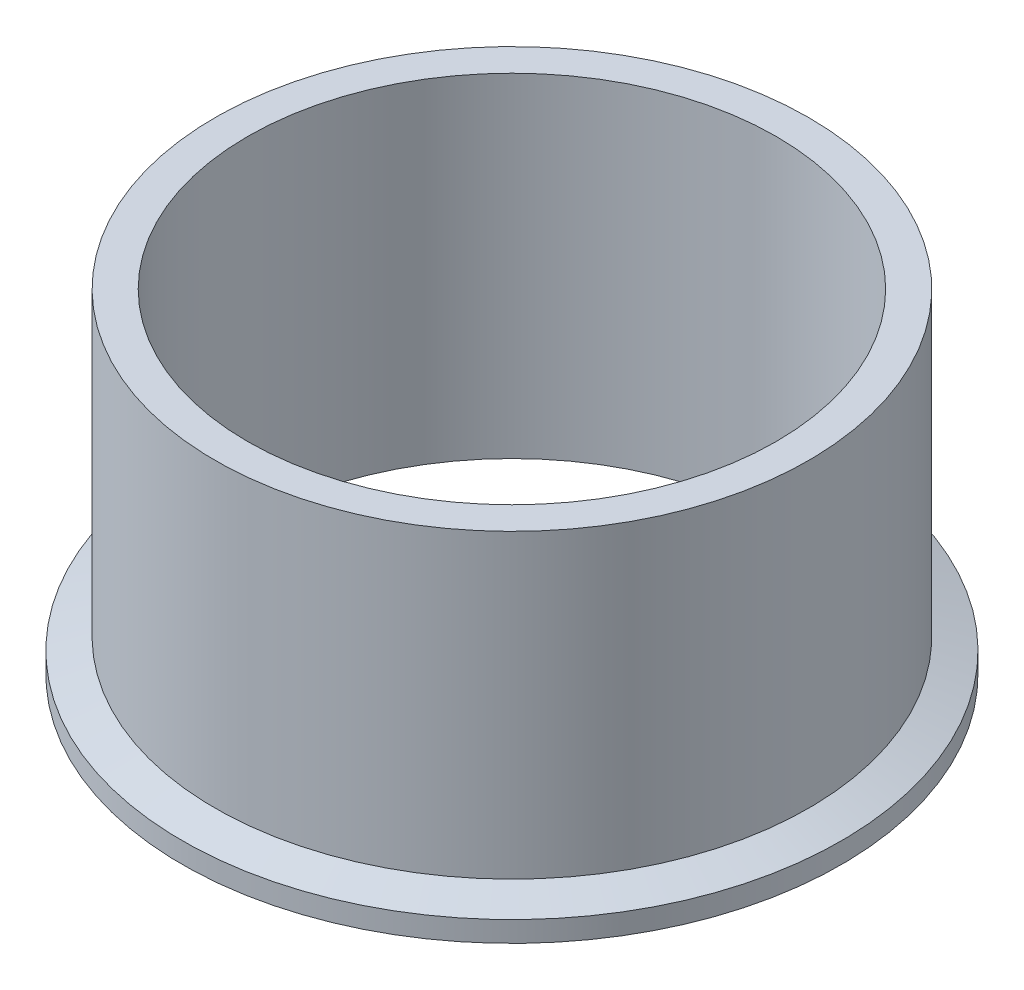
from build123d import *


with BuildPart() as part:
    # Sketch1 → Revolve2 (revolve)
    with BuildSketch(Plane.XY, mode=Mode.PRIVATE) as revolve2_sk:
        with BuildLine():
            Line((-36.449, 0), (-36.449, 46.0248))
            Line((-36.449, 46.0248), (-40.9448, 46.0248))
            Line((-40.9448, 46.0248), (-40.9448, 4.485759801))
            Line((-40.9448, 4.485759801), (-45.4533, 2.8448))
            Line((-45.4533, 2.8448), (-45.4533, 0))
            Line((-45.4533, 0), (-43.486708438, 0))
            ThreePointArc((-43.486708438, 0), (-43.054511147, 0.129217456), (-42.764166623, 0.474458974))
            ThreePointArc((-42.764166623, 0.474458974), (-41.6687, 1.1938), (-40.573233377, 0.474458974))
            ThreePointArc((-40.573233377, 0.474458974), (-40.282888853, 0.129217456), (-39.850691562, 0))
            Line((-39.850691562, 0), (-36.449, 0))
        make_face()
    revolve(revolve2_sk.sketch.rotate(Axis((0, 0, 0), (0, 1, 0)), 270), axis=Axis((0, 0, 0), (0, 1, 0)))


solid = part.part
